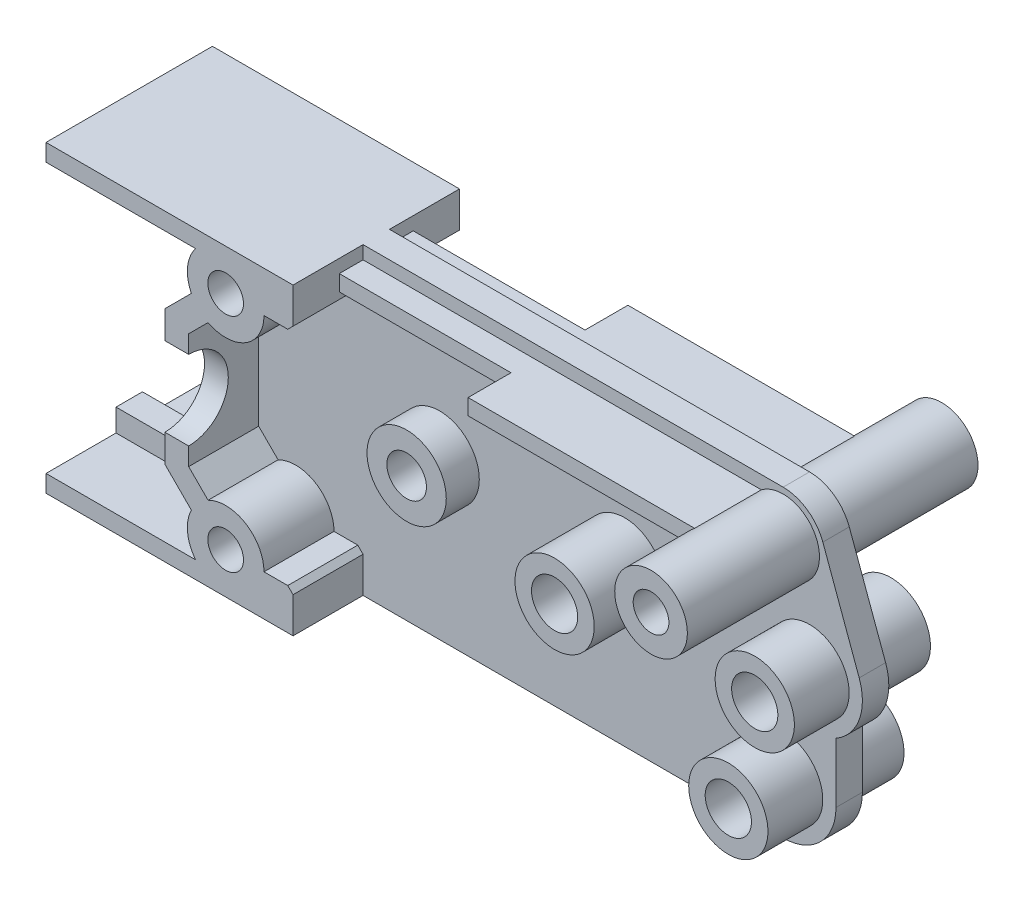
from build123d import *

# Parameters (mm, degrees)
SKETCH2_R           = 1.35
SKETCH2_R_2         = 1.5
SKETCH2_R_3         = 1.75
BOSS_EXTRUDE1_DEPTH = 1
SKETCH3_R           = 3
SKETCH3_R_2         = 1.75
BOSS_EXTRUDE2_DEPTH = 5.15
SKETCH4_R           = 3
SKETCH4_R_2         = 1.75
BOSS_EXTRUDE3_DEPTH = 6.3
SKETCH5_R           = 3
SKETCH5_R_2         = 1.5
BOSS_EXTRUDE4_DEPTH = 3.5
SKETCH6_R           = 2.75
SKETCH6_R_2         = 1.35
BOSS_EXTRUDE5_DEPTH = 11
SKETCH7_R           = 1.35
BOSS_EXTRUDE6_DEPTH = 6.3
BOSS_EXTRUDE7_DEPTH = 1.2
SKETCH9_R           = 1.35
CUT_EXTRUDE1_DEPTH  = 65.847898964
CUT_EXTRUDE2_REACH  = 55.91
CHAMFER2_SIZE       = 0.4


with BuildPart() as part:
    # Sketch2 → Boss-Extrude1 (new, symmetric)
    with BuildSketch(Plane.XY):
        with BuildLine():
            Line((0, 0), (50.5, 0))
            ThreePointArc((50.5, 0), (53.328427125, 1.171572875), (54.5, 4))
            Line((54.5, 4), (54.5, 8.535898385))
            ThreePointArc((54.5, 8.535898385), (56.259762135, 10.634647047), (56.256781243, 13.373533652))
            Line((56.256781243, 13.373533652), (53.505424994, 20.898826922))
            ThreePointArc((53.505424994, 20.898826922), (52.33354218, 22.4226176), (50.5, 23))
            Line((50.5, 23), (0, 23))
            Line((0, 23), (0, 20))
            Line((0, 20), (9, 20))
            Line((9, 20), (9, 3))
            Line((9, 3), (0, 3))
            Line((0, 3), (0, 0))
        make_face()
        with Locations((13.6, 3.1)):
            Circle(SKETCH2_R, mode=Mode.SUBTRACT)
        with Locations((24.5, 12)):
            Circle(SKETCH2_R_2, mode=Mode.SUBTRACT)
        with Locations((38.5, 12)):
            Circle(SKETCH2_R_3, mode=Mode.SUBTRACT)
        with Locations((52.5, 12)):
            Circle(SKETCH2_R_3, mode=Mode.SUBTRACT)
        with Locations((50.5, 4)):
            Circle(SKETCH2_R_3, mode=Mode.SUBTRACT)
        with Locations((50.5, 19.8)):
            Circle(SKETCH2_R, mode=Mode.SUBTRACT)
        with Locations(Location((13.6, 19.9, 0), (0, 0, 180))):
            Circle(SKETCH2_R, mode=Mode.SUBTRACT)
    extrude(amount=BOSS_EXTRUDE1_DEPTH, both=True)

    # Sketch3 → Boss-Extrude2 (add, symmetric)
    # profile 1 of 2: a face of its own
    with BuildSketch(Plane.XY):
        with Locations(Location((50.5, 4, 0), (0, 0, 180))):
            Circle(SKETCH3_R)
        with Locations((50.5, 4)):
            Circle(SKETCH3_R_2, mode=Mode.SUBTRACT)
    # profile 2 of 2: a face of its own
    with BuildSketch(Plane.XY):
        with Locations(Location((52.5, 12, 0), (0, 0, 180))):
            Circle(SKETCH3_R)
        with Locations((52.5, 12)):
            Circle(SKETCH3_R_2, mode=Mode.SUBTRACT)
    extrude(amount=BOSS_EXTRUDE2_DEPTH, both=True)

    # Sketch4 → Boss-Extrude3 (add, symmetric)
    with BuildSketch(Plane.XY):
        with Locations((38.5, 12)):
            Circle(SKETCH4_R)
        with Locations((38.5, 12)):
            Circle(SKETCH4_R_2, mode=Mode.SUBTRACT)
    extrude(amount=BOSS_EXTRUDE3_DEPTH, both=True)

    # Sketch5 → Boss-Extrude4 (add, symmetric)
    with BuildSketch(Plane.XY):
        with Locations((24.5, 12)):
            Circle(SKETCH5_R)
        with Locations((24.5, 12)):
            Circle(SKETCH5_R_2, mode=Mode.SUBTRACT)
    extrude(amount=BOSS_EXTRUDE4_DEPTH, both=True)

    # Sketch6 → Boss-Extrude5 (add, symmetric)
    with BuildSketch(Plane.XY):
        with Locations((50.5, 19.8)):
            Circle(SKETCH6_R)
        with Locations((50.5, 19.8)):
            Circle(SKETCH6_R_2, mode=Mode.SUBTRACT)
    extrude(amount=BOSS_EXTRUDE5_DEPTH, both=True)

    # Sketch7 → Boss-Extrude6 (add, symmetric)
    with BuildSketch(Plane.XY):
        with BuildLine():
            Line((0, 23), (18.7, 23))
            Line((18.7, 23), (18.7, 19.9))
            Line((18.7, 19.9), (16.5, 19.9))
            ThreePointArc((16.5, 19.9), (15.108348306, 17.423129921), (12.269044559, 17.323460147))
            Line((12.269044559, 17.323460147), (10.8, 15.854415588))
            Line((10.8, 15.854415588), (10.8, 11.5))
            Line((10.8, 11.5), (10.8, 7.145584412))
            Line((10.8, 7.145584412), (12.269044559, 5.676539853))
            ThreePointArc((12.269044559, 5.676539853), (15.108348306, 5.576870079), (16.5, 3.1))
            Line((16.5, 3.1), (18.7, 3.1))
            Line((18.7, 3.1), (18.7, 0))
            Line((18.7, 0), (0, 0))
            Line((0, 0), (0, 1.3))
            Line((0, 1.3), (11.3262366, 1.3))
            ThreePointArc((11.3262366, 1.3), (10.715483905, 2.800722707), (11.005134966, 4.394865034))
            Line((11.005134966, 4.394865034), (9, 6.4))
            Line((9, 6.4), (9, 11.5))
            Line((9, 11.5), (9, 16.6))
            Line((9, 16.6), (11.005134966, 18.605134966))
            ThreePointArc((11.005134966, 18.605134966), (10.715483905, 20.199277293), (11.3262366, 21.7))
            Line((11.3262366, 21.7), (0, 21.7))
            Line((0, 21.7), (0, 23))
        make_face()
        with Locations((13.6, 3.1)):
            Circle(SKETCH7_R, mode=Mode.SUBTRACT)
        with Locations((13.6, 19.9)):
            Circle(SKETCH7_R, mode=Mode.SUBTRACT)
    extrude(amount=BOSS_EXTRUDE6_DEPTH, both=True)

    # Sketch8 → Boss-Extrude7 (add)
    with BuildSketch(Plane(origin=(0, 22, 0), x_dir=(-1, 0, 0), z_dir=(0, 1, 0))):
        Polygon((-18.7, -2.8), (-18.7, 2.8), (-31.7, 2.8), (-31.7, 6.05), (-50.5, 6.05), (-50.5, -6.05), (-31.7, -6.05), (-31.7, -2.8), align=None)
    extrude(amount=-BOSS_EXTRUDE7_DEPTH)

    # Sketch9 → Cut-Extrude1 (cut, through all)
    with BuildSketch(Plane(origin=(0, 0, -11), x_dir=(-1, 0, 0), z_dir=(0, 0, -1))):
        with Locations(Location((-50.5, 19.8, 0), (0, 0, 180))):
            Circle(SKETCH9_R)
    extrude(amount=-CUT_EXTRUDE1_DEPTH, mode=Mode.SUBTRACT)

    # Sketch10 → Cut-Extrude2 (cut, up to next)
    with BuildSketch(Plane.ZY.offset(-9), mode=Mode.PRIVATE) as cut_extrude2_sk1:
        with BuildLine():
            Line((-6.3, 14.5), (-6.3, 8.5))
            ThreePointArc((-6.3, 8.5), (-3.3, 11.5), (-6.3, 14.5))
        make_face()
    cut_extrude2_tool1 = extrude(cut_extrude2_sk1.sketch, amount=-CUT_EXTRUDE2_REACH, mode=Mode.PRIVATE) & part.part
    # Sketch10 → Cut-Extrude2 (cut, up to next)
    with BuildSketch(Plane.ZY.offset(-9), mode=Mode.PRIVATE) as cut_extrude2_sk2:
        with BuildLine():
            Line((6.3, 8.5), (6.3, 14.5))
            ThreePointArc((6.3, 14.5), (3.3, 11.5), (6.3, 8.5))
        make_face()
    cut_extrude2_tool2 = extrude(cut_extrude2_sk2.sketch, amount=-CUT_EXTRUDE2_REACH, mode=Mode.PRIVATE) & part.part
    add(cut_extrude2_tool1.solids().sort_by_distance((9, 11.5, -5.02676))[0], mode=Mode.SUBTRACT)
    add(cut_extrude2_tool2.solids().sort_by_distance((9, 11.5, 5.02676))[0], mode=Mode.SUBTRACT)

    # Chamfer2
    chamfer2_edges = [part.edges().sort_by_distance(p)[0] for p in [
        (18.7, 3.1, -3.65),
        (18.7, 19.9, -3.65),
        (18.7, 3.1, 3.65),
        (18.7, 19.9, 3.65),
    ]]
    chamfer(chamfer2_edges, length=CHAMFER2_SIZE)


solid = part.part
